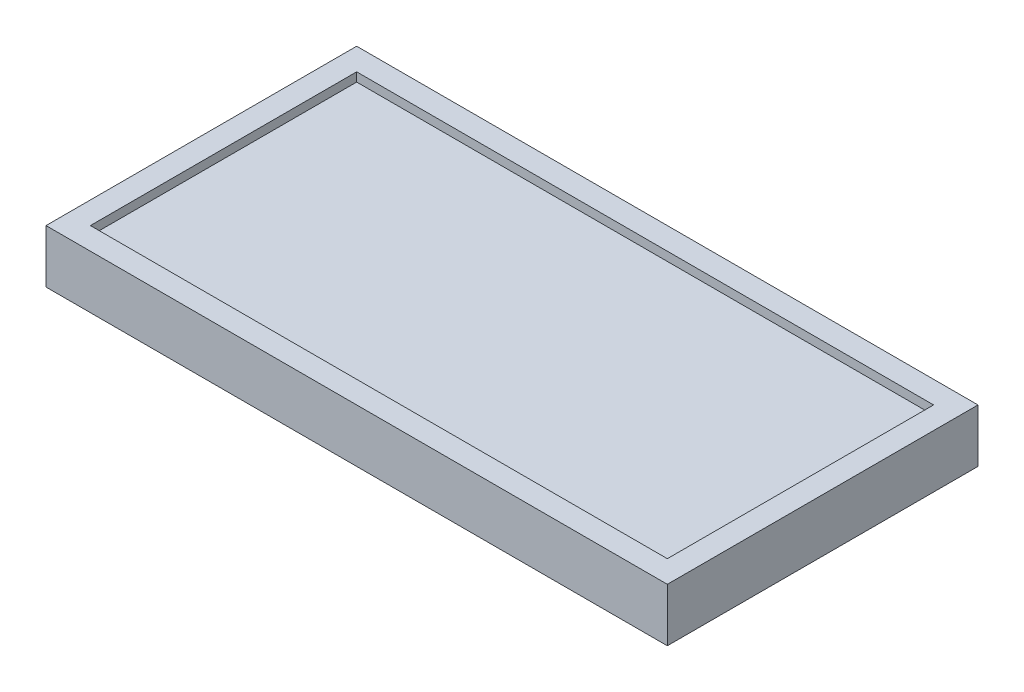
ISO-10303-21;
HEADER;
FILE_DESCRIPTION(('STEP AP214'),'2;1');
FILE_NAME('part.step','',(''),(''),'','','');
FILE_SCHEMA(('AUTOMOTIVE_DESIGN { 1 0 10303 214 1 1 1 1 }'));
ENDSEC;
DATA;
#1=APPLICATION_CONTEXT('core data for automotive mechanical design processes');
#2=APPLICATION_PROTOCOL_DEFINITION('international standard','automotive_design',2000,#1);
#3=PRODUCT_CONTEXT('',#1,'mechanical');
#4=PRODUCT('Part','Part','',(#3));
#5=PRODUCT_RELATED_PRODUCT_CATEGORY('part','',(#4));
#6=PRODUCT_DEFINITION_FORMATION('','',#4);
#7=PRODUCT_DEFINITION_CONTEXT('part definition',#1,'design');
#8=PRODUCT_DEFINITION('design','',#6,#7);
#9=PRODUCT_DEFINITION_SHAPE('','',#8);
#10=(LENGTH_UNIT() NAMED_UNIT(*) SI_UNIT(.MILLI.,.METRE.));
#11=(NAMED_UNIT(*) PLANE_ANGLE_UNIT() SI_UNIT($,.RADIAN.));
#12=(NAMED_UNIT(*) SI_UNIT($,.STERADIAN.) SOLID_ANGLE_UNIT());
#13=UNCERTAINTY_MEASURE_WITH_UNIT(LENGTH_MEASURE(1.E-05),#10,'distance_accuracy_value','');
#14=(GEOMETRIC_REPRESENTATION_CONTEXT(3) GLOBAL_UNCERTAINTY_ASSIGNED_CONTEXT((#13)) GLOBAL_UNIT_ASSIGNED_CONTEXT((#10,
#11,#12)) REPRESENTATION_CONTEXT('',''));
#15=CARTESIAN_POINT('',(0.,0.,0.));
#16=DIRECTION('',(0.,0.,1.));
#17=DIRECTION('',(1.,0.,0.));
#18=AXIS2_PLACEMENT_3D('',#15,#16,#17);
#19=CARTESIAN_POINT('',(0.,12.7,0.));
#20=DIRECTION('',(1.,0.,0.));
#21=DIRECTION('',(0.,0.,-1.));
#22=AXIS2_PLACEMENT_3D('',#19,#20,#21);
#23=PLANE('',#22);
#24=DIRECTION('',(0.,0.,1.));
#25=VECTOR('',#24,1.);
#26=CARTESIAN_POINT('',(0.,0.,0.));
#27=LINE('',#26,#25);
#28=CARTESIAN_POINT('',(0.,0.,-88.9));
#29=VERTEX_POINT('',#28);
#30=CARTESIAN_POINT('',(0.,0.,0.));
#31=VERTEX_POINT('',#30);
#32=EDGE_CURVE('E183',#29,#31,#27,.T.);
#33=ORIENTED_EDGE('',*,*,#32,.T.);
#34=DIRECTION('',(0.,-1.,0.));
#35=VECTOR('',#34,1.);
#36=CARTESIAN_POINT('',(0.,12.7,0.));
#37=LINE('',#36,#35);
#38=CARTESIAN_POINT('',(0.,15.24,0.));
#39=VERTEX_POINT('',#38);
#40=EDGE_CURVE('E11',#39,#31,#37,.T.);
#41=ORIENTED_EDGE('',*,*,#40,.F.);
#42=DIRECTION('',(0.,0.,1.));
#43=VECTOR('',#42,1.);
#44=CARTESIAN_POINT('',(0.,15.24,0.));
#45=LINE('',#44,#43);
#46=CARTESIAN_POINT('',(0.,15.24,-88.9));
#47=VERTEX_POINT('',#46);
#48=EDGE_CURVE('E134',#47,#39,#45,.T.);
#49=ORIENTED_EDGE('',*,*,#48,.F.);
#50=DIRECTION('',(0.,-1.,0.));
#51=VECTOR('',#50,1.);
#52=CARTESIAN_POINT('',(0.,12.7,-88.9));
#53=LINE('',#52,#51);
#54=EDGE_CURVE('E195',#47,#29,#53,.T.);
#55=ORIENTED_EDGE('',*,*,#54,.T.);
#56=EDGE_LOOP('',(#33,#41,#49,#55));
#57=FACE_BOUND('',#56,.T.);
#58=ADVANCED_FACE('F49',(#57),#23,.F.);
#59=CARTESIAN_POINT('',(0.,12.7,0.));
#60=DIRECTION('',(0.,0.,-1.));
#61=DIRECTION('',(-1.,0.,0.));
#62=AXIS2_PLACEMENT_3D('',#59,#60,#61);
#63=PLANE('',#62);
#64=DIRECTION('',(1.,0.,0.));
#65=VECTOR('',#64,1.);
#66=CARTESIAN_POINT('',(0.,0.,0.));
#67=LINE('',#66,#65);
#68=CARTESIAN_POINT('',(177.8,0.,0.));
#69=VERTEX_POINT('',#68);
#70=EDGE_CURVE('E187',#31,#69,#67,.T.);
#71=ORIENTED_EDGE('',*,*,#70,.T.);
#72=DIRECTION('',(0.,-1.,0.));
#73=VECTOR('',#72,1.);
#74=CARTESIAN_POINT('',(177.8,12.7,0.));
#75=LINE('',#74,#73);
#76=CARTESIAN_POINT('',(177.8,15.24,0.));
#77=VERTEX_POINT('',#76);
#78=EDGE_CURVE('E57',#77,#69,#75,.T.);
#79=ORIENTED_EDGE('',*,*,#78,.F.);
#80=DIRECTION('',(1.,0.,0.));
#81=VECTOR('',#80,1.);
#82=CARTESIAN_POINT('',(0.,15.24,0.));
#83=LINE('',#82,#81);
#84=EDGE_CURVE('E171',#39,#77,#83,.T.);
#85=ORIENTED_EDGE('',*,*,#84,.F.);
#86=ORIENTED_EDGE('',*,*,#40,.T.);
#87=EDGE_LOOP('',(#71,#79,#85,#86));
#88=FACE_BOUND('',#87,.T.);
#89=ADVANCED_FACE('F216',(#88),#63,.F.);
#90=CARTESIAN_POINT('',(177.8,12.7,0.));
#91=DIRECTION('',(-1.,0.,0.));
#92=DIRECTION('',(0.,0.,1.));
#93=AXIS2_PLACEMENT_3D('',#90,#91,#92);
#94=PLANE('',#93);
#95=DIRECTION('',(0.,0.,-1.));
#96=VECTOR('',#95,1.);
#97=CARTESIAN_POINT('',(177.8,0.,0.));
#98=LINE('',#97,#96);
#99=CARTESIAN_POINT('',(177.8,0.,-88.9));
#100=VERTEX_POINT('',#99);
#101=EDGE_CURVE('E190',#69,#100,#98,.T.);
#102=ORIENTED_EDGE('',*,*,#101,.T.);
#103=DIRECTION('',(0.,-1.,0.));
#104=VECTOR('',#103,1.);
#105=CARTESIAN_POINT('',(177.8,12.7,-88.9));
#106=LINE('',#105,#104);
#107=CARTESIAN_POINT('',(177.8,15.24,-88.9));
#108=VERTEX_POINT('',#107);
#109=EDGE_CURVE('E198',#108,#100,#106,.T.);
#110=ORIENTED_EDGE('',*,*,#109,.F.);
#111=DIRECTION('',(0.,0.,-1.));
#112=VECTOR('',#111,1.);
#113=CARTESIAN_POINT('',(177.8,15.24,0.));
#114=LINE('',#113,#112);
#115=EDGE_CURVE('E175',#77,#108,#114,.T.);
#116=ORIENTED_EDGE('',*,*,#115,.F.);
#117=ORIENTED_EDGE('',*,*,#78,.T.);
#118=EDGE_LOOP('',(#102,#110,#116,#117));
#119=FACE_BOUND('',#118,.T.);
#120=ADVANCED_FACE('F205',(#119),#94,.F.);
#121=CARTESIAN_POINT('',(0.,12.7,-88.9));
#122=DIRECTION('',(0.,0.,1.));
#123=DIRECTION('',(1.,0.,0.));
#124=AXIS2_PLACEMENT_3D('',#121,#122,#123);
#125=PLANE('',#124);
#126=DIRECTION('',(-1.,0.,0.));
#127=VECTOR('',#126,1.);
#128=CARTESIAN_POINT('',(0.,0.,-88.9));
#129=LINE('',#128,#127);
#130=EDGE_CURVE('E72',#100,#29,#129,.T.);
#131=ORIENTED_EDGE('',*,*,#130,.T.);
#132=ORIENTED_EDGE('',*,*,#54,.F.);
#133=DIRECTION('',(-1.,0.,0.));
#134=VECTOR('',#133,1.);
#135=CARTESIAN_POINT('',(0.,15.24,-88.9));
#136=LINE('',#135,#134);
#137=EDGE_CURVE('E179',#108,#47,#136,.T.);
#138=ORIENTED_EDGE('',*,*,#137,.F.);
#139=ORIENTED_EDGE('',*,*,#109,.T.);
#140=EDGE_LOOP('',(#131,#132,#138,#139));
#141=FACE_BOUND('',#140,.T.);
#142=ADVANCED_FACE('F214',(#141),#125,.F.);
#143=CARTESIAN_POINT('',(0.,0.,0.));
#144=DIRECTION('',(0.,-1.,0.));
#145=DIRECTION('',(0.,0.,-1.));
#146=AXIS2_PLACEMENT_3D('',#143,#144,#145);
#147=PLANE('',#146);
#148=ORIENTED_EDGE('',*,*,#32,.F.);
#149=ORIENTED_EDGE('',*,*,#130,.F.);
#150=ORIENTED_EDGE('',*,*,#101,.F.);
#151=ORIENTED_EDGE('',*,*,#70,.F.);
#152=EDGE_LOOP('',(#148,#149,#150,#151));
#153=FACE_BOUND('',#152,.T.);
#154=ADVANCED_FACE('F210',(#153),#147,.T.);
#155=CARTESIAN_POINT('',(0.,15.24,0.));
#156=DIRECTION('',(0.,-1.,0.));
#157=DIRECTION('',(0.,0.,-1.));
#158=AXIS2_PLACEMENT_3D('',#155,#156,#157);
#159=PLANE('',#158);
#160=ORIENTED_EDGE('',*,*,#48,.T.);
#161=ORIENTED_EDGE('',*,*,#84,.T.);
#162=ORIENTED_EDGE('',*,*,#115,.T.);
#163=ORIENTED_EDGE('',*,*,#137,.T.);
#164=EDGE_LOOP('',(#160,#161,#162,#163));
#165=FACE_BOUND('',#164,.T.);
#166=DIRECTION('',(0.,0.,1.));
#167=VECTOR('',#166,1.);
#168=CARTESIAN_POINT('',(6.35,15.24,-6.35));
#169=LINE('',#168,#167);
#170=CARTESIAN_POINT('',(6.35,15.24,-82.55));
#171=VERTEX_POINT('',#170);
#172=CARTESIAN_POINT('',(6.35,15.24,-6.35));
#173=VERTEX_POINT('',#172);
#174=EDGE_CURVE('E116',#171,#173,#169,.T.);
#175=ORIENTED_EDGE('',*,*,#174,.F.);
#176=DIRECTION('',(-1.,0.,0.));
#177=VECTOR('',#176,1.);
#178=CARTESIAN_POINT('',(6.35,15.24,-82.55));
#179=LINE('',#178,#177);
#180=CARTESIAN_POINT('',(171.45,15.24,-82.55));
#181=VERTEX_POINT('',#180);
#182=EDGE_CURVE('E144',#181,#171,#179,.T.);
#183=ORIENTED_EDGE('',*,*,#182,.F.);
#184=DIRECTION('',(0.,0.,-1.));
#185=VECTOR('',#184,1.);
#186=CARTESIAN_POINT('',(171.45,15.24,-6.35));
#187=LINE('',#186,#185);
#188=CARTESIAN_POINT('',(171.45,15.24,-6.35));
#189=VERTEX_POINT('',#188);
#190=EDGE_CURVE('E140',#189,#181,#187,.T.);
#191=ORIENTED_EDGE('',*,*,#190,.F.);
#192=DIRECTION('',(1.,0.,0.));
#193=VECTOR('',#192,1.);
#194=CARTESIAN_POINT('',(6.35,15.24,-6.35));
#195=LINE('',#194,#193);
#196=EDGE_CURVE('E125',#173,#189,#195,.T.);
#197=ORIENTED_EDGE('',*,*,#196,.F.);
#198=EDGE_LOOP('',(#175,#183,#191,#197));
#199=FACE_BOUND('',#198,.T.);
#200=ADVANCED_FACE('F138',(#165,#199),#159,.F.);
#201=CARTESIAN_POINT('',(6.35,15.24,-6.35));
#202=DIRECTION('',(1.,0.,0.));
#203=DIRECTION('',(0.,0.,-1.));
#204=AXIS2_PLACEMENT_3D('',#201,#202,#203);
#205=PLANE('',#204);
#206=DIRECTION('',(0.,0.,1.));
#207=VECTOR('',#206,1.);
#208=CARTESIAN_POINT('',(6.35,12.7,-6.35));
#209=LINE('',#208,#207);
#210=CARTESIAN_POINT('',(6.35,12.7,-82.55));
#211=VERTEX_POINT('',#210);
#212=CARTESIAN_POINT('',(6.35,12.7,-6.35));
#213=VERTEX_POINT('',#212);
#214=EDGE_CURVE('E149',#211,#213,#209,.T.);
#215=ORIENTED_EDGE('',*,*,#214,.F.);
#216=DIRECTION('',(0.,-1.,0.));
#217=VECTOR('',#216,1.);
#218=CARTESIAN_POINT('',(6.35,15.24,-82.55));
#219=LINE('',#218,#217);
#220=EDGE_CURVE('E64',#171,#211,#219,.T.);
#221=ORIENTED_EDGE('',*,*,#220,.F.);
#222=ORIENTED_EDGE('',*,*,#174,.T.);
#223=DIRECTION('',(0.,-1.,0.));
#224=VECTOR('',#223,1.);
#225=CARTESIAN_POINT('',(6.35,15.24,-6.35));
#226=LINE('',#225,#224);
#227=EDGE_CURVE('E119',#173,#213,#226,.T.);
#228=ORIENTED_EDGE('',*,*,#227,.T.);
#229=EDGE_LOOP('',(#215,#221,#222,#228));
#230=FACE_BOUND('',#229,.T.);
#231=ADVANCED_FACE('F118',(#230),#205,.T.);
#232=CARTESIAN_POINT('',(6.35,15.24,-6.35));
#233=DIRECTION('',(0.,0.,-1.));
#234=DIRECTION('',(-1.,0.,0.));
#235=AXIS2_PLACEMENT_3D('',#232,#233,#234);
#236=PLANE('',#235);
#237=DIRECTION('',(1.,0.,0.));
#238=VECTOR('',#237,1.);
#239=CARTESIAN_POINT('',(6.35,12.7,-6.35));
#240=LINE('',#239,#238);
#241=CARTESIAN_POINT('',(171.45,12.7,-6.35));
#242=VERTEX_POINT('',#241);
#243=EDGE_CURVE('E132',#213,#242,#240,.T.);
#244=ORIENTED_EDGE('',*,*,#243,.F.);
#245=ORIENTED_EDGE('',*,*,#227,.F.);
#246=ORIENTED_EDGE('',*,*,#196,.T.);
#247=DIRECTION('',(0.,-1.,0.));
#248=VECTOR('',#247,1.);
#249=CARTESIAN_POINT('',(171.45,15.24,-6.35));
#250=LINE('',#249,#248);
#251=EDGE_CURVE('E135',#189,#242,#250,.T.);
#252=ORIENTED_EDGE('',*,*,#251,.T.);
#253=EDGE_LOOP('',(#244,#245,#246,#252));
#254=FACE_BOUND('',#253,.T.);
#255=ADVANCED_FACE('F129',(#254),#236,.T.);
#256=CARTESIAN_POINT('',(171.45,15.24,-6.35));
#257=DIRECTION('',(-1.,0.,0.));
#258=DIRECTION('',(0.,0.,1.));
#259=AXIS2_PLACEMENT_3D('',#256,#257,#258);
#260=PLANE('',#259);
#261=DIRECTION('',(0.,0.,-1.));
#262=VECTOR('',#261,1.);
#263=CARTESIAN_POINT('',(171.45,12.7,-6.35));
#264=LINE('',#263,#262);
#265=CARTESIAN_POINT('',(171.45,12.7,-82.55));
#266=VERTEX_POINT('',#265);
#267=EDGE_CURVE('E154',#242,#266,#264,.T.);
#268=ORIENTED_EDGE('',*,*,#267,.F.);
#269=ORIENTED_EDGE('',*,*,#251,.F.);
#270=ORIENTED_EDGE('',*,*,#190,.T.);
#271=DIRECTION('',(0.,-1.,0.));
#272=VECTOR('',#271,1.);
#273=CARTESIAN_POINT('',(171.45,15.24,-82.55));
#274=LINE('',#273,#272);
#275=EDGE_CURVE('E163',#181,#266,#274,.T.);
#276=ORIENTED_EDGE('',*,*,#275,.T.);
#277=EDGE_LOOP('',(#268,#269,#270,#276));
#278=FACE_BOUND('',#277,.T.);
#279=ADVANCED_FACE('F239',(#278),#260,.T.);
#280=CARTESIAN_POINT('',(6.35,15.24,-82.55));
#281=DIRECTION('',(0.,0.,1.));
#282=DIRECTION('',(1.,0.,0.));
#283=AXIS2_PLACEMENT_3D('',#280,#281,#282);
#284=PLANE('',#283);
#285=DIRECTION('',(-1.,0.,0.));
#286=VECTOR('',#285,1.);
#287=CARTESIAN_POINT('',(6.35,12.7,-82.55));
#288=LINE('',#287,#286);
#289=EDGE_CURVE('E126',#266,#211,#288,.T.);
#290=ORIENTED_EDGE('',*,*,#289,.F.);
#291=ORIENTED_EDGE('',*,*,#275,.F.);
#292=ORIENTED_EDGE('',*,*,#182,.T.);
#293=ORIENTED_EDGE('',*,*,#220,.T.);
#294=EDGE_LOOP('',(#290,#291,#292,#293));
#295=FACE_BOUND('',#294,.T.);
#296=ADVANCED_FACE('F231',(#295),#284,.T.);
#297=CARTESIAN_POINT('',(0.,12.7,0.));
#298=DIRECTION('',(0.,-1.,0.));
#299=DIRECTION('',(0.,0.,-1.));
#300=AXIS2_PLACEMENT_3D('',#297,#298,#299);
#301=PLANE('',#300);
#302=ORIENTED_EDGE('',*,*,#289,.T.);
#303=ORIENTED_EDGE('',*,*,#214,.T.);
#304=ORIENTED_EDGE('',*,*,#243,.T.);
#305=ORIENTED_EDGE('',*,*,#267,.T.);
#306=EDGE_LOOP('',(#302,#303,#304,#305));
#307=FACE_BOUND('',#306,.T.);
#308=ADVANCED_FACE('F228',(#307),#301,.F.);
#309=CLOSED_SHELL('',(#58,#89,#120,#142,#154,#200,#231,#255,#279,#296,#308));
#310=MANIFOLD_SOLID_BREP('B2',#309);
#311=ADVANCED_BREP_SHAPE_REPRESENTATION('',(#18,#310),#14);
#312=SHAPE_DEFINITION_REPRESENTATION(#9,#311);
ENDSEC;
END-ISO-10303-21;
